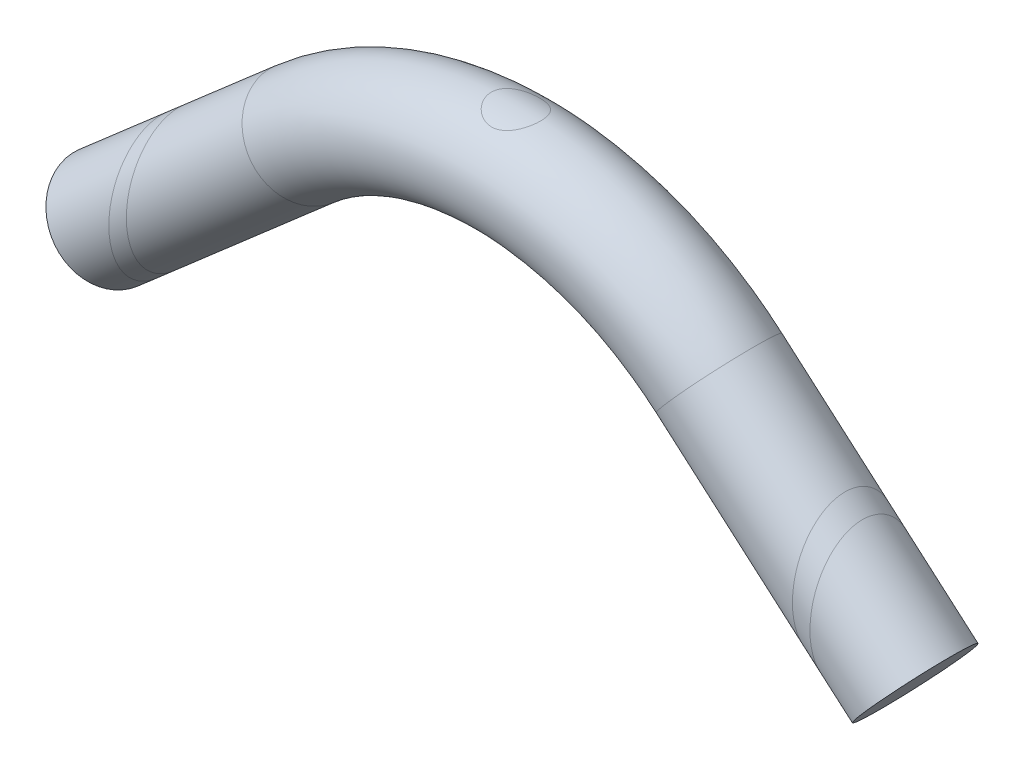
ISO-10303-21;
HEADER;
FILE_DESCRIPTION(('STEP AP214'),'2;1');
FILE_NAME('part.step','',(''),(''),'','','');
FILE_SCHEMA(('AUTOMOTIVE_DESIGN { 1 0 10303 214 1 1 1 1 }'));
ENDSEC;
DATA;
#1=APPLICATION_CONTEXT('core data for automotive mechanical design processes');
#2=APPLICATION_PROTOCOL_DEFINITION('international standard','automotive_design',2000,#1);
#3=PRODUCT_CONTEXT('',#1,'mechanical');
#4=PRODUCT('Part','Part','',(#3));
#5=PRODUCT_RELATED_PRODUCT_CATEGORY('part','',(#4));
#6=PRODUCT_DEFINITION_FORMATION('','',#4);
#7=PRODUCT_DEFINITION_CONTEXT('part definition',#1,'design');
#8=PRODUCT_DEFINITION('design','',#6,#7);
#9=PRODUCT_DEFINITION_SHAPE('','',#8);
#10=(LENGTH_UNIT() NAMED_UNIT(*) SI_UNIT(.MILLI.,.METRE.));
#11=(NAMED_UNIT(*) PLANE_ANGLE_UNIT() SI_UNIT($,.RADIAN.));
#12=(NAMED_UNIT(*) SI_UNIT($,.STERADIAN.) SOLID_ANGLE_UNIT());
#13=UNCERTAINTY_MEASURE_WITH_UNIT(LENGTH_MEASURE(1.E-05),#10,'distance_accuracy_value','');
#14=(GEOMETRIC_REPRESENTATION_CONTEXT(3) GLOBAL_UNCERTAINTY_ASSIGNED_CONTEXT((#13)) GLOBAL_UNIT_ASSIGNED_CONTEXT((#10,
#11,#12)) REPRESENTATION_CONTEXT('',''));
#15=CARTESIAN_POINT('',(0.,0.,0.));
#16=DIRECTION('',(0.,0.,1.));
#17=DIRECTION('',(1.,0.,0.));
#18=AXIS2_PLACEMENT_3D('',#15,#16,#17);
#19=CARTESIAN_POINT('',(55.9439156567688,48.6468831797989,0.));
#20=DIRECTION('',(-0.754605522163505,-0.656178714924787,0.));
#21=DIRECTION('',(0.656178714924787,-0.754605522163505,0.));
#22=AXIS2_PLACEMENT_3D('',#19,#20,#21);
#23=CYLINDRICAL_SURFACE('',#22,15.);
#24=CARTESIAN_POINT('',(55.9439156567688,48.6468831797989,0.));
#25=DIRECTION('',(0.7546055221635,0.656178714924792,0.));
#26=DIRECTION('',(0.,0.,-1.));
#27=AXIS2_PLACEMENT_3D('',#24,#25,#26);
#28=CIRCLE('',#27,15.);
#29=CARTESIAN_POINT('',(55.9439156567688,48.6468831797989,-15.));
#30=VERTEX_POINT('',#29);
#31=EDGE_CURVE('E128',#30,#30,#28,.T.);
#32=ORIENTED_EDGE('',*,*,#31,.F.);
#33=EDGE_LOOP('',(#32));
#34=FACE_BOUND('',#33,.T.);
#35=CARTESIAN_POINT('',(20.,17.3913043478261,0.));
#36=DIRECTION('',(1.,0.,0.));
#37=DIRECTION('',(0.,-1.,0.));
#38=AXIS2_PLACEMENT_3D('',#35,#36,#37);
#39=ELLIPSE('',#38,19.8779356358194,15.);
#40=CARTESIAN_POINT('',(20.,-2.48663128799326,0.));
#41=VERTEX_POINT('',#40);
#42=EDGE_CURVE('E11',#41,#41,#39,.T.);
#43=ORIENTED_EDGE('',*,*,#42,.T.);
#44=EDGE_LOOP('',(#43));
#45=FACE_BOUND('',#44,.T.);
#46=ADVANCED_FACE('F50',(#34,#45),#23,.T.);
#47=CARTESIAN_POINT('',(174.056084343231,48.6468831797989,0.));
#48=DIRECTION('',(0.754605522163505,-0.656178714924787,0.));
#49=DIRECTION('',(0.656178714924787,0.754605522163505,0.));
#50=AXIS2_PLACEMENT_3D('',#47,#48,#49);
#51=CYLINDRICAL_SURFACE('',#50,15.);
#52=CARTESIAN_POINT('',(174.056084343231,48.6468831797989,0.));
#53=DIRECTION('',(0.754605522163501,-0.656178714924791,0.));
#54=DIRECTION('',(0.,0.,-1.));
#55=AXIS2_PLACEMENT_3D('',#52,#53,#54);
#56=CIRCLE('',#55,15.);
#57=CARTESIAN_POINT('',(174.056084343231,48.6468831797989,-15.));
#58=VERTEX_POINT('',#57);
#59=EDGE_CURVE('E136',#58,#58,#56,.T.);
#60=ORIENTED_EDGE('',*,*,#59,.T.);
#61=EDGE_LOOP('',(#60));
#62=FACE_BOUND('',#61,.T.);
#63=CARTESIAN_POINT('',(210.,17.3913043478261,0.));
#64=DIRECTION('',(-1.,0.,0.));
#65=DIRECTION('',(0.,-1.,0.));
#66=AXIS2_PLACEMENT_3D('',#63,#64,#65);
#67=ELLIPSE('',#66,19.8779356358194,15.);
#68=CARTESIAN_POINT('',(210.,-2.48663128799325,0.));
#69=VERTEX_POINT('',#68);
#70=EDGE_CURVE('E53',#69,#69,#67,.T.);
#71=ORIENTED_EDGE('',*,*,#70,.T.);
#72=EDGE_LOOP('',(#71));
#73=FACE_BOUND('',#72,.T.);
#74=ADVANCED_FACE('F105',(#62,#73),#51,.T.);
#75=ORIENTED_EDGE('',*,*,#70,.F.);
#76=EDGE_LOOP('',(#75));
#77=FACE_BOUND('',#76,.T.);
#78=CARTESIAN_POINT('',(215.,13.0434782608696,0.));
#79=DIRECTION('',(-1.,0.,0.));
#80=DIRECTION('',(0.,-1.,0.));
#81=AXIS2_PLACEMENT_3D('',#78,#79,#80);
#82=ELLIPSE('',#81,19.8779356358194,15.);
#83=CARTESIAN_POINT('',(215.,-6.83445737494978,0.));
#84=VERTEX_POINT('',#83);
#85=EDGE_CURVE('E59',#84,#84,#82,.T.);
#86=ORIENTED_EDGE('',*,*,#85,.T.);
#87=EDGE_LOOP('',(#86));
#88=FACE_BOUND('',#87,.T.);
#89=ADVANCED_FACE('F101',(#77,#88),#51,.T.);
#90=ORIENTED_EDGE('',*,*,#42,.F.);
#91=EDGE_LOOP('',(#90));
#92=FACE_BOUND('',#91,.T.);
#93=CARTESIAN_POINT('',(15.,13.0434782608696,0.));
#94=DIRECTION('',(1.,0.,0.));
#95=DIRECTION('',(0.,-1.,0.));
#96=AXIS2_PLACEMENT_3D('',#93,#94,#95);
#97=ELLIPSE('',#96,19.8779356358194,15.);
#98=CARTESIAN_POINT('',(15.,-6.83445737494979,0.));
#99=VERTEX_POINT('',#98);
#100=EDGE_CURVE('E65',#99,#99,#97,.T.);
#101=ORIENTED_EDGE('',*,*,#100,.T.);
#102=EDGE_LOOP('',(#101));
#103=FACE_BOUND('',#102,.T.);
#104=ADVANCED_FACE('F92',(#92,#103),#23,.T.);
#105=CARTESIAN_POINT('',(115.,-19.2676138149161,0.));
#106=DIRECTION('',(0.,0.,-1.));
#107=DIRECTION('',(-1.,0.,0.));
#108=AXIS2_PLACEMENT_3D('',#105,#106,#107);
#109=TOROIDAL_SURFACE('',#108,90.,15.);
#110=CARTESIAN_POINT('',(110.588080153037,85.0106860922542,-4.2962066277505));
#111=CARTESIAN_POINT('',(110.710333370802,84.9688042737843,-4.4534690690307));
#112=CARTESIAN_POINT('',(110.839197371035,84.9257780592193,-4.60537547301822));
#113=CARTESIAN_POINT('',(111.1092662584,84.8385685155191,-4.89755901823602));
#114=CARTESIAN_POINT('',(111.250478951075,84.7943844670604,-5.03782869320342));
#115=CARTESIAN_POINT('',(111.544722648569,84.7059378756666,-5.30620513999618));
#116=CARTESIAN_POINT('',(111.697783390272,84.6616754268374,-5.43427938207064));
#117=CARTESIAN_POINT('',(112.014505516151,84.5744150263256,-5.67705037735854));
#118=CARTESIAN_POINT('',(112.1781667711,84.5314170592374,-5.7917472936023));
#119=CARTESIAN_POINT('',(112.515366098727,84.4478828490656,-6.00711752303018));
#120=CARTESIAN_POINT('',(112.688915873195,84.4073496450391,-6.10777371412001));
#121=CARTESIAN_POINT('',(113.044595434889,84.3300760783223,-6.29406440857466));
#122=CARTESIAN_POINT('',(113.226720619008,84.2933337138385,-6.37970685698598));
#123=CARTESIAN_POINT('',(113.598324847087,84.2248607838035,-6.53519724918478));
#124=CARTESIAN_POINT('',(113.787797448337,84.1931259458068,-6.60505867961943));
#125=CARTESIAN_POINT('',(114.172914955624,84.1357511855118,-6.72834766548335));
#126=CARTESIAN_POINT('',(114.36855940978,84.1101108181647,-6.78177642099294));
#127=CARTESIAN_POINT('',(114.755652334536,84.0668680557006,-6.8695575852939));
#128=CARTESIAN_POINT('',(114.946897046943,84.0489574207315,-6.90465638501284));
#129=CARTESIAN_POINT('',(115.332170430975,84.020196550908,-6.95885151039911));
#130=CARTESIAN_POINT('',(115.526199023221,84.0093461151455,-6.97794829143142));
#131=CARTESIAN_POINT('',(115.915391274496,83.9950818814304,-6.99987763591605));
#132=CARTESIAN_POINT('',(116.110554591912,83.9916659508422,-7.00271486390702));
#133=CARTESIAN_POINT('',(116.500417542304,83.9923464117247,-6.99207973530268));
#134=CARTESIAN_POINT('',(116.695117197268,83.9964424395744,-6.97860816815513));
#135=CARTESIAN_POINT('',(117.067728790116,84.0113360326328,-6.93714730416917));
#136=CARTESIAN_POINT('',(117.245794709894,84.0216021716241,-6.91033566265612));
#137=CARTESIAN_POINT('',(117.598975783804,84.0479765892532,-6.84317181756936));
#138=CARTESIAN_POINT('',(117.774089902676,84.0640868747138,-6.80281496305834));
#139=CARTESIAN_POINT('',(118.120129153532,84.1015870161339,-6.70895336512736));
#140=CARTESIAN_POINT('',(118.291055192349,84.1229757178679,-6.65545149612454));
#141=CARTESIAN_POINT('',(118.627805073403,84.1703534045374,-6.53573510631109));
#142=CARTESIAN_POINT('',(118.793626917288,84.1963441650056,-6.46951567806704));
#143=CARTESIAN_POINT('',(119.123873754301,84.2529417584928,-6.3228119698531));
#144=CARTESIAN_POINT('',(119.28812184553,84.2836597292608,-6.24197261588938));
#145=CARTESIAN_POINT('',(119.609366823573,84.3482341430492,-6.06795742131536));
#146=CARTESIAN_POINT('',(119.766361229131,84.3820916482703,-5.97477740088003));
#147=CARTESIAN_POINT('',(120.072280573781,84.4520067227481,-5.7766867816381));
#148=CARTESIAN_POINT('',(120.221204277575,84.4880646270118,-5.67177439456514));
#149=CARTESIAN_POINT('',(120.510238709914,84.5614402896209,-5.4508349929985));
#150=CARTESIAN_POINT('',(120.65034900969,84.5987581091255,-5.33480743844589));
#151=CARTESIAN_POINT('',(120.9322498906,84.6768284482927,-5.08223563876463));
#152=CARTESIAN_POINT('',(121.073224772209,84.7176102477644,-4.94478843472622));
#153=CARTESIAN_POINT('',(121.343156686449,84.798425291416,-4.65844140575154));
#154=CARTESIAN_POINT('',(121.472117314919,84.8384587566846,-4.50954503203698));
#155=CARTESIAN_POINT('',(121.71730888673,84.9167306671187,-4.20103378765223));
#156=CARTESIAN_POINT('',(121.833533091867,84.9549681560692,-4.04141331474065));
#157=CARTESIAN_POINT('',(122.052303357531,85.0285885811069,-3.71252862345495));
#158=CARTESIAN_POINT('',(122.154855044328,85.0639726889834,-3.54326841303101));
#159=CARTESIAN_POINT('',(122.346717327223,85.1313755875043,-3.19392038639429));
#160=CARTESIAN_POINT('',(122.435847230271,85.1633470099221,-3.01372402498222));
#161=CARTESIAN_POINT('',(122.598482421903,85.2225141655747,-2.64573895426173));
#162=CARTESIAN_POINT('',(122.671994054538,85.2497118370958,-2.45795336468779));
#163=CARTESIAN_POINT('',(122.802698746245,85.2985764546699,-2.07611951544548));
#164=CARTESIAN_POINT('',(122.859894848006,85.320244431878,-1.88207243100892));
#165=CARTESIAN_POINT('',(122.957367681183,85.3574319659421,-1.48919977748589));
#166=CARTESIAN_POINT('',(122.997645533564,85.3729519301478,-1.29037452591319));
#167=CARTESIAN_POINT('',(123.058913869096,85.3966527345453,-0.901706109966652));
#168=CARTESIAN_POINT('',(123.080923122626,85.4052205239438,-0.712046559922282));
#169=CARTESIAN_POINT('',(123.109372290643,85.4163072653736,-0.331389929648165));
#170=CARTESIAN_POINT('',(123.115812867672,85.4188264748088,-0.140392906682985));
#171=CARTESIAN_POINT('',(123.113056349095,85.4177499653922,0.241433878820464));
#172=CARTESIAN_POINT('',(123.10386215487,85.4141553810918,0.432263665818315));
#173=CARTESIAN_POINT('',(123.069940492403,85.4009480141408,0.81232491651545));
#174=CARTESIAN_POINT('',(123.045213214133,85.391335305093,1.00155639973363));
#175=CARTESIAN_POINT('',(122.981706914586,85.3668148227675,1.36992080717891));
#176=CARTESIAN_POINT('',(122.943492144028,85.3521200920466,1.54916566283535));
#177=CARTESIAN_POINT('',(122.853261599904,85.3177364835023,1.90371771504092));
#178=CARTESIAN_POINT('',(122.801241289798,85.2980459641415,2.07902359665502));
#179=CARTESIAN_POINT('',(122.683878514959,85.2541417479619,2.42447362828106));
#180=CARTESIAN_POINT('',(122.618539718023,85.2299292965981,2.59461918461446));
#181=CARTESIAN_POINT('',(122.475036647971,85.1775264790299,2.92884814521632));
#182=CARTESIAN_POINT('',(122.396867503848,85.1493346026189,3.09292921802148));
#183=CARTESIAN_POINT('',(122.225485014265,85.0886207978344,3.41941645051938));
#184=CARTESIAN_POINT('',(122.131856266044,85.0559856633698,3.58158346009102));
#185=CARTESIAN_POINT('',(121.932185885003,84.9879273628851,3.89754163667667));
#186=CARTESIAN_POINT('',(121.826139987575,84.9525032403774,4.05132989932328));
#187=CARTESIAN_POINT('',(121.602331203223,84.8797145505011,4.34968686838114));
#188=CARTESIAN_POINT('',(121.484566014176,84.8423496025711,4.49425375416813));
#189=CARTESIAN_POINT('',(121.238034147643,84.7665831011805,4.77339229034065));
#190=CARTESIAN_POINT('',(121.109267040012,84.7281815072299,4.90796354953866));
#191=CARTESIAN_POINT('',(120.83296549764,84.6488510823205,5.17458545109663));
#192=CARTESIAN_POINT('',(120.68475926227,84.6079159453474,5.30593902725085));
#193=CARTESIAN_POINT('',(120.377627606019,84.5271266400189,5.55570944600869));
#194=CARTESIAN_POINT('',(120.218705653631,84.4872721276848,5.67413044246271));
#195=CARTESIAN_POINT('',(119.89091851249,84.4098115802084,5.89736247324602));
#196=CARTESIAN_POINT('',(119.722048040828,84.3722067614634,6.00216618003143));
#197=CARTESIAN_POINT('',(119.375507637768,84.3004965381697,6.19726639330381));
#198=CARTESIAN_POINT('',(119.197841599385,84.2663896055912,6.28756924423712));
#199=CARTESIAN_POINT('',(118.834269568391,84.2027551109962,6.45317700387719));
#200=CARTESIAN_POINT('',(118.648343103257,84.1732398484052,6.5284417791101));
#201=CARTESIAN_POINT('',(118.270045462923,84.1200229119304,6.6629125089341));
#202=CARTESIAN_POINT('',(118.077677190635,84.0963186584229,6.72212559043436));
#203=CARTESIAN_POINT('',(117.687969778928,84.0556852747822,6.82386208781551));
#204=CARTESIAN_POINT('',(117.490633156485,84.0387527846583,6.86639378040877));
#205=CARTESIAN_POINT('',(117.092538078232,84.01239764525,6.93429383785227));
#206=CARTESIAN_POINT('',(116.891779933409,84.0029743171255,6.95966375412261));
#207=CARTESIAN_POINT('',(116.504768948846,83.9925301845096,6.99159556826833));
#208=CARTESIAN_POINT('',(116.318642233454,83.990896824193,6.99950115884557));
#209=CARTESIAN_POINT('',(115.94641886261,83.9944771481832,7.00045299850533));
#210=CARTESIAN_POINT('',(115.760322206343,83.9996905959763,6.99349976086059));
#211=CARTESIAN_POINT('',(115.389592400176,84.0168226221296,6.96483359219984));
#212=CARTESIAN_POINT('',(115.204959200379,84.0287409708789,6.94312116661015));
#213=CARTESIAN_POINT('',(114.838509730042,84.0589036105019,6.88519875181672));
#214=CARTESIAN_POINT('',(114.656693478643,84.0771479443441,6.84898866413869));
#215=CARTESIAN_POINT('',(114.3028996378,84.1187028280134,6.76385396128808));
#216=CARTESIAN_POINT('',(114.130793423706,84.1418324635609,6.7153735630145));
#217=CARTESIAN_POINT('',(113.791370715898,84.1928110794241,6.60563055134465));
#218=CARTESIAN_POINT('',(113.624055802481,84.2206615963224,6.54436377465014));
#219=CARTESIAN_POINT('',(113.295192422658,84.2803103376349,6.40955658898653));
#220=CARTESIAN_POINT('',(113.133643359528,84.3121081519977,6.3360174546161));
#221=CARTESIAN_POINT('',(112.817077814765,84.3788300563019,6.17718672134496));
#222=CARTESIAN_POINT('',(112.66206372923,84.4137552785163,6.09189085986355));
#223=CARTESIAN_POINT('',(112.185889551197,84.527199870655,5.80590071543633));
#224=CARTESIAN_POINT('',(111.877636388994,84.6098627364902,5.58486502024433));
#225=CARTESIAN_POINT('',(111.300992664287,84.7771921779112,5.09626568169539));
#226=CARTESIAN_POINT('',(111.032618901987,84.8618595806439,4.82868253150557));
#227=CARTESIAN_POINT('',(110.656758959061,84.9868457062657,4.38774965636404));
#228=CARTESIAN_POINT('',(110.532732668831,85.0293850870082,4.22886253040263));
#229=CARTESIAN_POINT('',(110.298553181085,85.1116147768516,3.90051516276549));
#230=CARTESIAN_POINT('',(110.188394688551,85.1513061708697,3.73105899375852));
#231=CARTESIAN_POINT('',(109.982792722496,85.2267917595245,3.38255586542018));
#232=CARTESIAN_POINT('',(109.887353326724,85.2625848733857,3.20350626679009));
#233=CARTESIAN_POINT('',(109.712122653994,85.3292764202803,2.83712420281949));
#234=CARTESIAN_POINT('',(109.632323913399,85.3601771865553,2.64979574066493));
#235=CARTESIAN_POINT('',(109.491432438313,85.4153422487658,2.27427805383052));
#236=CARTESIAN_POINT('',(109.429820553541,85.4397880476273,2.08631035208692));
#237=CARTESIAN_POINT('',(109.322620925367,85.4826476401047,1.70526817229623));
#238=CARTESIAN_POINT('',(109.277026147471,85.5010640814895,1.51219597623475));
#239=CARTESIAN_POINT('',(109.202346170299,85.531371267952,1.12244027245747));
#240=CARTESIAN_POINT('',(109.173255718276,85.5432640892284,0.925757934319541));
#241=CARTESIAN_POINT('',(109.131906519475,85.5602014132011,0.53034304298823));
#242=CARTESIAN_POINT('',(109.119646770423,85.5652463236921,0.331610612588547));
#243=CARTESIAN_POINT('',(109.112361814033,85.5682422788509,-0.0525573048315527));
#244=CARTESIAN_POINT('',(109.116211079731,85.5666566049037,-0.237968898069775));
#245=CARTESIAN_POINT('',(109.138590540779,85.5574650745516,-0.607752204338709));
#246=CARTESIAN_POINT('',(109.157120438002,85.5498593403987,-0.792123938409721));
#247=CARTESIAN_POINT('',(109.208680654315,85.5288071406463,-1.15857657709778));
#248=CARTESIAN_POINT('',(109.241717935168,85.5153578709,-1.3406563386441));
#249=CARTESIAN_POINT('',(109.321961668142,85.4829410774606,-1.70115684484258));
#250=CARTESIAN_POINT('',(109.369167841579,85.4639736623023,-1.87957766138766));
#251=CARTESIAN_POINT('',(109.476837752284,85.4211512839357,-2.23007003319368));
#252=CARTESIAN_POINT('',(109.537184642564,85.397339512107,-2.40218284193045));
#253=CARTESIAN_POINT('',(109.670873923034,85.345256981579,-2.74067575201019));
#254=CARTESIAN_POINT('',(109.744222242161,85.3169841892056,-2.9070531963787));
#255=CARTESIAN_POINT('',(109.903134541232,85.2566806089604,-3.23268376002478));
#256=CARTESIAN_POINT('',(109.988671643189,85.2246581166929,-3.3919515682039));
#257=CARTESIAN_POINT('',(110.171469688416,85.157496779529,-3.70290615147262));
#258=CARTESIAN_POINT('',(110.268728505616,85.1223585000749,-3.85459429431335));
#259=CARTESIAN_POINT('',(110.406347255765,85.0737364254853,-4.05208266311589));
#260=CARTESIAN_POINT('',(110.441822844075,85.0612916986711,-4.10159895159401));
#261=CARTESIAN_POINT('',(110.514020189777,85.0361622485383,-4.1996455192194));
#262=CARTESIAN_POINT('',(110.550741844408,85.0234775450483,-4.248175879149));
#263=CARTESIAN_POINT('',(110.588080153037,85.0106860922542,-4.2962066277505));
#264=B_SPLINE_CURVE_WITH_KNOTS('',3,(#110,#111,#112,#113,#114,#115,#116,#117,#118,#119,#120,
#121,#122,#123,#124,#125,#126,#127,#128,#129,#130,#131,#132,#133,#134,#135,#136,#137,#138,#139,
#140,#141,#142,#143,#144,#145,#146,#147,#148,#149,#150,#151,#152,#153,#154,#155,#156,#157,#158,
#159,#160,#161,#162,#163,#164,#165,#166,#167,#168,#169,#170,#171,#172,#173,#174,#175,#176,#177,
#178,#179,#180,#181,#182,#183,#184,#185,#186,#187,#188,#189,#190,#191,#192,#193,#194,#195,#196,
#197,#198,#199,#200,#201,#202,#203,#204,#205,#206,#207,#208,#209,#210,#211,#212,#213,#214,#215,
#216,#217,#218,#219,#220,#221,#222,#223,#224,#225,#226,#227,#228,#229,#230,#231,#232,#233,#234,
#235,#236,#237,#238,#239,#240,#241,#242,#243,#244,#245,#246,#247,#248,#249,#250,#251,#252,#253,
#254,#255,#256,#257,#258,#259,#260,#261,#262,#263),.UNSPECIFIED.,.T.,.F.,(4,2,2,2,2,2,2,2,2,2,2,
2,2,2,2,2,2,2,2,2,2,2,2,2,2,2,2,2,2,2,2,2,2,2,2,2,2,2,2,2,2,2,2,2,2,2,2,2,2,2,2,2,2,2,2,2,2,2,2,
2,2,2,2,2,2,2,2,2,2,2,2,2,2,2,2,2,4),(0.,0.610583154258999,1.22155508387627,1.83411354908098,
2.44666454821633,3.05995611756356,3.67292215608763,4.28536234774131,4.89775780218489,
5.4827606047,6.06774675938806,6.65256508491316,7.23735510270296,7.77782479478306,
8.31848025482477,8.85901759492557,9.39976393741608,9.9560409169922,10.5125067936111,
11.0690576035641,11.6256354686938,12.2281490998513,12.8304818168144,13.433131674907,
14.0355327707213,14.6454316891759,15.2550823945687,15.8646193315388,16.4741158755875,
17.0467669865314,17.6193937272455,18.1919142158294,18.7644277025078,19.3153806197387,
19.8665148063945,20.4174974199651,20.9686896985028,21.5382990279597,22.1081045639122,
22.678022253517,23.2479622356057,23.8539298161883,24.4597021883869,25.0657991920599,
25.6716302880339,26.2790572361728,26.8862140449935,27.49306922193,28.0998695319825,
28.6580674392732,29.216246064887,29.7744055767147,30.3325688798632,30.8728608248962,
31.4133289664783,31.9537410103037,32.4943495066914,33.6537163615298,34.8135702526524,
35.4309340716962,36.0480614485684,36.6653594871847,37.2823622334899,37.879517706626,
38.4764105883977,39.0731133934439,39.6697806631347,40.2254808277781,40.7811697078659,
41.3371255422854,41.8930704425,42.4442602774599,42.9957021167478,43.5459462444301,
44.0960907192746,44.2825890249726,44.4690719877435),.UNSPECIFIED.);
#265=CARTESIAN_POINT('',(110.588080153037,85.0106860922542,-4.2962066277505));
#266=VERTEX_POINT('',#265);
#267=EDGE_CURVE('E69',#266,#266,#264,.T.);
#268=ORIENTED_EDGE('',*,*,#267,.T.);
#269=EDGE_LOOP('',(#268));
#270=FACE_BOUND('',#269,.T.);
#271=ORIENTED_EDGE('',*,*,#31,.T.);
#272=EDGE_LOOP('',(#271));
#273=FACE_BOUND('',#272,.T.);
#274=ORIENTED_EDGE('',*,*,#59,.F.);
#275=EDGE_LOOP('',(#274));
#276=FACE_BOUND('',#275,.T.);
#277=CARTESIAN_POINT('',(109.933391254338,55.9260523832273,-3.28518633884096));
#278=CARTESIAN_POINT('',(109.850554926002,55.885405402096,-3.12933368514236));
#279=CARTESIAN_POINT('',(109.773418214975,55.8468356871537,-2.96996870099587));
#280=CARTESIAN_POINT('',(109.631107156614,55.7747094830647,-2.64490910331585));
#281=CARTESIAN_POINT('',(109.565928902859,55.7411513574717,-2.47921657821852));
#282=CARTESIAN_POINT('',(109.448105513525,55.6798497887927,-2.14230960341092));
#283=CARTESIAN_POINT('',(109.395465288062,55.6521086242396,-1.97109302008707));
#284=CARTESIAN_POINT('',(109.30331881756,55.6031764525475,-1.62431099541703));
#285=CARTESIAN_POINT('',(109.26380711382,55.5819827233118,-1.44874739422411));
#286=CARTESIAN_POINT('',(109.19823362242,55.5466375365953,-1.09376995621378));
#287=CARTESIAN_POINT('',(109.172219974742,55.5325112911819,-0.914344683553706));
#288=CARTESIAN_POINT('',(109.134183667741,55.5118103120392,-0.553578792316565));
#289=CARTESIAN_POINT('',(109.122161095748,55.5052356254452,-0.372238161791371));
#290=CARTESIAN_POINT('',(109.112266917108,55.4998269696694,-0.0090883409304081));
#291=CARTESIAN_POINT('',(109.114392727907,55.5009915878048,0.172720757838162));
#292=CARTESIAN_POINT('',(109.132761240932,55.5110249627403,0.535405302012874));
#293=CARTESIAN_POINT('',(109.149003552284,55.5198935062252,0.716280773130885));
#294=CARTESIAN_POINT('',(109.194351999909,55.5445161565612,1.06766132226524));
#295=CARTESIAN_POINT('',(109.222850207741,55.5599445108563,1.23826836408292));
#296=CARTESIAN_POINT('',(109.292221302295,55.5972131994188,1.57629228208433));
#297=CARTESIAN_POINT('',(109.333098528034,55.6190557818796,1.74370801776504));
#298=CARTESIAN_POINT('',(109.42678661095,55.6686122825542,2.07422933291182));
#299=CARTESIAN_POINT('',(109.479595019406,55.6963249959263,2.23733578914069));
#300=CARTESIAN_POINT('',(109.596671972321,55.7569884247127,2.55843976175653));
#301=CARTESIAN_POINT('',(109.660945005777,55.7899411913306,2.71643524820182));
#302=CARTESIAN_POINT('',(109.803620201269,55.8619713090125,3.03363393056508));
#303=CARTESIAN_POINT('',(109.882536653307,55.9012607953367,3.19255779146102));
#304=CARTESIAN_POINT('',(110.051700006,55.9838618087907,3.50319043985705));
#305=CARTESIAN_POINT('',(110.141950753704,56.0271747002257,3.65489675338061));
#306=CARTESIAN_POINT('',(110.428795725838,56.1617269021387,4.09820480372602));
#307=CARTESIAN_POINT('',(110.64154113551,56.2576102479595,4.37812457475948));
#308=CARTESIAN_POINT('',(111.132614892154,56.4651011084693,4.93278331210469));
#309=CARTESIAN_POINT('',(111.415692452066,56.5772406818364,5.20313606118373));
#310=CARTESIAN_POINT('',(111.871962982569,56.7405613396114,5.5711918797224));
#311=CARTESIAN_POINT('',(112.029453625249,56.794223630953,5.68770192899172));
#312=CARTESIAN_POINT('',(112.354438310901,56.8984238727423,5.90758204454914));
#313=CARTESIAN_POINT('',(112.521933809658,56.9489613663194,6.01095019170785));
#314=CARTESIAN_POINT('',(112.872765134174,57.0472016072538,6.20744543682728));
#315=CARTESIAN_POINT('',(113.056463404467,57.094718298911,6.30001960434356));
#316=CARTESIAN_POINT('',(113.432595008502,57.1829107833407,6.46909885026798));
#317=CARTESIAN_POINT('',(113.625023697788,57.2235901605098,6.54561235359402));
#318=CARTESIAN_POINT('',(114.017158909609,57.2964360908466,6.68159298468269));
#319=CARTESIAN_POINT('',(114.216857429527,57.3286117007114,6.74107825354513));
#320=CARTESIAN_POINT('',(114.622039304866,57.3830352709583,6.84220611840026));
#321=CARTESIAN_POINT('',(114.827521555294,57.4052851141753,6.88385209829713));
#322=CARTESIAN_POINT('',(115.217354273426,57.4367328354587,6.94471296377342));
#323=CARTESIAN_POINT('',(115.401279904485,57.4471770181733,6.96602063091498));
#324=CARTESIAN_POINT('',(115.770527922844,57.4590600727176,6.99398833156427));
#325=CARTESIAN_POINT('',(115.955850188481,57.460499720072,7.00064962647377));
#326=CARTESIAN_POINT('',(116.326238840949,57.4542531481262,6.99925059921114));
#327=CARTESIAN_POINT('',(116.51130527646,57.4465690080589,6.99119363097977));
#328=CARTESIAN_POINT('',(116.87963072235,57.4223125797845,6.96052483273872));
#329=CARTESIAN_POINT('',(117.062889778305,57.4057405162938,6.93791337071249));
#330=CARTESIAN_POINT('',(117.40965439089,57.3661480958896,6.88119790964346));
#331=CARTESIAN_POINT('',(117.573445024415,57.3438482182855,6.84832112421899));
#332=CARTESIAN_POINT('',(117.897363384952,57.2929767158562,6.77123078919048));
#333=CARTESIAN_POINT('',(118.057489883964,57.2644030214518,6.72701349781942));
#334=CARTESIAN_POINT('',(118.530994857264,57.1703626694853,6.5780281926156));
#335=CARTESIAN_POINT('',(118.837722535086,57.09654962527,6.45688942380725));
#336=CARTESIAN_POINT('',(119.453484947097,56.9264219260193,6.16267158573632));
#337=CARTESIAN_POINT('',(119.760383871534,56.8287055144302,5.98598162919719));
#338=CARTESIAN_POINT('',(120.342251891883,56.6241435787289,5.59026743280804));
#339=CARTESIAN_POINT('',(120.617198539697,56.5172917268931,5.37121371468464));
#340=CARTESIAN_POINT('',(121.167239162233,56.2882922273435,4.86110788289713));
#341=CARTESIAN_POINT('',(121.43702584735,56.1660858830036,4.56427808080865));
#342=CARTESIAN_POINT('',(121.801980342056,55.9919702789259,4.08586020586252));
#343=CARTESIAN_POINT('',(121.917064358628,55.9354349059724,3.92075668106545));
#344=CARTESIAN_POINT('',(122.13321618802,55.8268803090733,3.58010025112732));
#345=CARTESIAN_POINT('',(122.234282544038,55.7748615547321,3.40454626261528));
#346=CARTESIAN_POINT('',(122.421895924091,55.6765783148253,3.04301517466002));
#347=CARTESIAN_POINT('',(122.508361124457,55.6303466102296,2.85698665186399));
#348=CARTESIAN_POINT('',(122.665069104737,55.5454021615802,2.47665936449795));
#349=CARTESIAN_POINT('',(122.735320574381,55.5066853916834,2.28236509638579));
#350=CARTESIAN_POINT('',(122.858640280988,55.4380433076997,1.88705594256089));
#351=CARTESIAN_POINT('',(122.911722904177,55.4081106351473,1.68604684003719));
#352=CARTESIAN_POINT('',(122.999939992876,55.3580485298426,1.27893799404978));
#353=CARTESIAN_POINT('',(123.035077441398,55.337917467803,1.07283910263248));
#354=CARTESIAN_POINT('',(123.083559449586,55.3100574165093,0.6836250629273));
#355=CARTESIAN_POINT('',(123.099083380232,55.3010902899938,0.500866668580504));
#356=CARTESIAN_POINT('',(123.115726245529,55.2914748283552,0.134483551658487));
#357=CARTESIAN_POINT('',(123.116846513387,55.2908257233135,-0.0491410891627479));
#358=CARTESIAN_POINT('',(123.104667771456,55.2978648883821,-0.415711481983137));
#359=CARTESIAN_POINT('',(123.091371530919,55.3055515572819,-0.598657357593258));
#360=CARTESIAN_POINT('',(123.050555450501,55.329033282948,-0.962422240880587));
#361=CARTESIAN_POINT('',(123.02303577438,55.3448282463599,-1.1432412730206));
#362=CARTESIAN_POINT('',(122.956437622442,55.3827706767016,-1.48944929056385));
#363=CARTESIAN_POINT('',(122.918249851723,55.4044256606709,-1.65506455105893));
#364=CARTESIAN_POINT('',(122.830226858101,55.4538864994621,-1.98225207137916));
#365=CARTESIAN_POINT('',(122.780387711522,55.4816944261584,-2.14382294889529));
#366=CARTESIAN_POINT('',(122.614127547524,55.5734192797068,-2.62099858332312));
#367=CARTESIAN_POINT('',(122.480912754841,55.6456673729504,-2.92932741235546));
#368=CARTESIAN_POINT('',(122.16266660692,55.8123722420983,-3.54250955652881));
#369=CARTESIAN_POINT('',(121.974502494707,55.90808679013,-3.84537433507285));
#370=CARTESIAN_POINT('',(121.556607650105,56.1100774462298,-4.41704614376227));
#371=CARTESIAN_POINT('',(121.326848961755,56.2163606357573,-4.68583006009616));
#372=CARTESIAN_POINT('',(120.798507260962,56.4445796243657,-5.21713390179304));
#373=CARTESIAN_POINT('',(120.494899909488,56.5668001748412,-5.47459651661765));
#374=CARTESIAN_POINT('',(120.008454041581,56.7424748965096,-5.82045871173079));
#375=CARTESIAN_POINT('',(119.841013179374,56.7997921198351,-5.92908201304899));
#376=CARTESIAN_POINT('',(119.496356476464,56.9102842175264,-6.13219508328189));
#377=CARTESIAN_POINT('',(119.319139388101,56.9634585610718,-6.22668304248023));
#378=CARTESIAN_POINT('',(118.952475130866,57.064925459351,-6.40223813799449));
#379=CARTESIAN_POINT('',(118.762861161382,57.1131080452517,-6.48302105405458));
#380=CARTESIAN_POINT('',(118.375727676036,57.2016966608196,-6.62797561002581));
#381=CARTESIAN_POINT('',(118.178212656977,57.242107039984,-6.69215654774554));
#382=CARTESIAN_POINT('',(117.77690577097,57.3135602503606,-6.80294567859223));
#383=CARTESIAN_POINT('',(117.573121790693,57.3446143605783,-6.84957504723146));
#384=CARTESIAN_POINT('',(117.160904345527,57.3961027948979,-6.9245316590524));
#385=CARTESIAN_POINT('',(116.952471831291,57.4165392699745,-6.95286260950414));
#386=CARTESIAN_POINT('',(116.561845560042,57.4438989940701,-6.98806225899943));
#387=CARTESIAN_POINT('',(116.379967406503,57.4522895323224,-6.99733876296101));
#388=CARTESIAN_POINT('',(116.01585647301,57.4602593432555,-7.00167005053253));
#389=CARTESIAN_POINT('',(115.833623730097,57.4598394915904,-6.99672624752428));
#390=CARTESIAN_POINT('',(115.470348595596,57.4502660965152,-6.97266497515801));
#391=CARTESIAN_POINT('',(115.289306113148,57.4411132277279,-6.95354860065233));
#392=CARTESIAN_POINT('',(114.929866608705,57.4144750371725,-6.90140193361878));
#393=CARTESIAN_POINT('',(114.751469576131,57.3969897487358,-6.86837169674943));
#394=CARTESIAN_POINT('',(114.411640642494,57.3559320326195,-6.79175506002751));
#395=CARTESIAN_POINT('',(114.249926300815,57.332902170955,-6.74912422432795));
#396=CARTESIAN_POINT('',(113.93079648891,57.2809746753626,-6.65272483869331));
#397=CARTESIAN_POINT('',(113.77338247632,57.2520750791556,-6.59895256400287));
#398=CARTESIAN_POINT('',(113.308815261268,57.1577552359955,-6.4216209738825));
#399=CARTESIAN_POINT('',(113.009179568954,57.084693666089,-6.28201092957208));
#400=CARTESIAN_POINT('',(112.405896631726,56.9171793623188,-5.94780617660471));
#401=CARTESIAN_POINT('',(112.104980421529,56.821302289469,-5.74904499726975));
#402=CARTESIAN_POINT('',(111.538416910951,56.6230240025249,-5.30913801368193));
#403=CARTESIAN_POINT('',(111.272766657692,56.520623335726,-5.06799576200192));
#404=CARTESIAN_POINT('',(110.81267729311,56.3314986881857,-4.58113048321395));
#405=CARTESIAN_POINT('',(110.613472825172,56.2444556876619,-4.34000639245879));
#406=CARTESIAN_POINT('',(110.247901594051,56.0780784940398,-3.83139325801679));
#407=CARTESIAN_POINT('',(110.08153211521,55.9987436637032,-3.56390639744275));
#408=CARTESIAN_POINT('',(109.933391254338,55.9260523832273,-3.28518633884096));
#409=B_SPLINE_CURVE_WITH_KNOTS('',3,(#277,#278,#279,#280,#281,#282,#283,#284,#285,#286,#287,
#288,#289,#290,#291,#292,#293,#294,#295,#296,#297,#298,#299,#300,#301,#302,#303,#304,#305,#306,
#307,#308,#309,#310,#311,#312,#313,#314,#315,#316,#317,#318,#319,#320,#321,#322,#323,#324,#325,
#326,#327,#328,#329,#330,#331,#332,#333,#334,#335,#336,#337,#338,#339,#340,#341,#342,#343,#344,
#345,#346,#347,#348,#349,#350,#351,#352,#353,#354,#355,#356,#357,#358,#359,#360,#361,#362,#363,
#364,#365,#366,#367,#368,#369,#370,#371,#372,#373,#374,#375,#376,#377,#378,#379,#380,#381,#382,
#383,#384,#385,#386,#387,#388,#389,#390,#391,#392,#393,#394,#395,#396,#397,#398,#399,#400,#401,
#402,#403,#404,#405,#406,#407,#408),.UNSPECIFIED.,.T.,.F.,(4,2,2,2,2,2,2,2,2,2,2,2,2,2,2,2,2,2,
2,2,2,2,2,2,2,2,2,2,2,2,2,2,2,2,2,2,2,2,2,2,2,2,2,2,2,2,2,2,2,2,2,2,2,2,2,2,2,2,2,2,2,2,2,2,2,
4),(0.,0.543124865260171,1.08607199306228,1.62923140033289,2.17216468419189,2.7170212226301,
3.26188116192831,3.80664164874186,4.35138705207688,4.87176476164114,5.39232508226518,
5.91277866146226,6.43343647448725,6.97806685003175,7.52288258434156,8.61208418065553,
9.82792244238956,10.4367184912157,11.045603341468,11.6781116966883,12.3102874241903,
12.9417871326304,13.5731669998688,14.1287430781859,14.6842713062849,15.2396729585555,
15.7950605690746,16.3001162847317,16.8053388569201,17.8151062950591,18.913017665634,
20.0116957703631,21.2633135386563,21.8898263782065,22.5164042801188,23.1463846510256,
23.7760265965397,24.4051395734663,25.0341479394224,25.5843230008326,26.1344471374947,
26.6844656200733,27.2344777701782,27.7479016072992,28.2614985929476,29.2878984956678,
30.3911445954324,31.4951349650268,32.7382405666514,33.3606085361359,33.9830561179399,
34.6171511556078,35.2508903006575,35.8838623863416,36.5167061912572,37.0628864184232,
37.6090123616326,38.1550961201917,38.7011776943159,39.2070780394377,39.7131477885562,
40.7248046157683,41.8400535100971,42.9552089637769,43.9265900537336,44.8978907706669),.UNSPECIFIED.);
#410=CARTESIAN_POINT('',(109.933391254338,55.9260523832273,-3.28518633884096));
#411=VERTEX_POINT('',#410);
#412=EDGE_CURVE('E67',#411,#411,#409,.T.);
#413=ORIENTED_EDGE('',*,*,#412,.T.);
#414=EDGE_LOOP('',(#413));
#415=FACE_BOUND('',#414,.T.);
#416=ADVANCED_FACE('F87',(#270,#273,#276,#415),#109,.T.);
#417=ORIENTED_EDGE('',*,*,#412,.F.);
#418=EDGE_LOOP('',(#417));
#419=FACE_BOUND('',#418,.T.);
#420=ADVANCED_FACE('F89',(#419),#109,.T.);
#421=ORIENTED_EDGE('',*,*,#100,.F.);
#422=EDGE_LOOP('',(#421));
#423=FACE_BOUND('',#422,.T.);
#424=CARTESIAN_POINT('',(0.,0.,0.));
#425=DIRECTION('',(0.7546055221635,0.656178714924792,0.));
#426=DIRECTION('',(0.,0.,-1.));
#427=AXIS2_PLACEMENT_3D('',#424,#425,#426);
#428=CIRCLE('',#427,15.);
#429=CARTESIAN_POINT('',(0.,0.,-15.));
#430=VERTEX_POINT('',#429);
#431=EDGE_CURVE('E75',#430,#430,#428,.T.);
#432=ORIENTED_EDGE('',*,*,#431,.T.);
#433=EDGE_LOOP('',(#432));
#434=FACE_BOUND('',#433,.T.);
#435=ADVANCED_FACE('F83',(#423,#434),#23,.T.);
#436=ORIENTED_EDGE('',*,*,#267,.F.);
#437=EDGE_LOOP('',(#436));
#438=FACE_BOUND('',#437,.T.);
#439=ADVANCED_FACE('F78',(#438),#109,.T.);
#440=CARTESIAN_POINT('',(0.,0.,0.));
#441=DIRECTION('',(0.7546055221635,0.656178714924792,0.));
#442=DIRECTION('',(0.,0.,-1.));
#443=AXIS2_PLACEMENT_3D('',#440,#441,#442);
#444=PLANE('',#443);
#445=ORIENTED_EDGE('',*,*,#431,.F.);
#446=EDGE_LOOP('',(#445));
#447=FACE_BOUND('',#446,.T.);
#448=ADVANCED_FACE('F81',(#447),#444,.F.);
#449=ORIENTED_EDGE('',*,*,#85,.F.);
#450=EDGE_LOOP('',(#449));
#451=FACE_BOUND('',#450,.T.);
#452=CARTESIAN_POINT('',(230.,0.,0.));
#453=DIRECTION('',(0.754605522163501,-0.656178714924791,0.));
#454=DIRECTION('',(0.,0.,-1.));
#455=AXIS2_PLACEMENT_3D('',#452,#453,#454);
#456=CIRCLE('',#455,15.);
#457=CARTESIAN_POINT('',(230.,0.,-15.));
#458=VERTEX_POINT('',#457);
#459=EDGE_CURVE('E132',#458,#458,#456,.T.);
#460=ORIENTED_EDGE('',*,*,#459,.F.);
#461=EDGE_LOOP('',(#460));
#462=FACE_BOUND('',#461,.T.);
#463=ADVANCED_FACE('F98',(#451,#462),#51,.T.);
#464=CARTESIAN_POINT('',(230.,0.,0.));
#465=DIRECTION('',(-0.754605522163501,0.656178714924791,0.));
#466=DIRECTION('',(0.,0.,-1.));
#467=AXIS2_PLACEMENT_3D('',#464,#465,#466);
#468=PLANE('',#467);
#469=ORIENTED_EDGE('',*,*,#459,.T.);
#470=EDGE_LOOP('',(#469));
#471=FACE_BOUND('',#470,.T.);
#472=ADVANCED_FACE('F99',(#471),#468,.F.);
#473=CLOSED_SHELL('',(#46,#74,#89,#104,#416,#420,#435,#439,#448,#463,#472));
#474=MANIFOLD_SOLID_BREP('B2',#473);
#475=ADVANCED_BREP_SHAPE_REPRESENTATION('',(#18,#474),#14);
#476=SHAPE_DEFINITION_REPRESENTATION(#9,#475);
ENDSEC;
END-ISO-10303-21;
